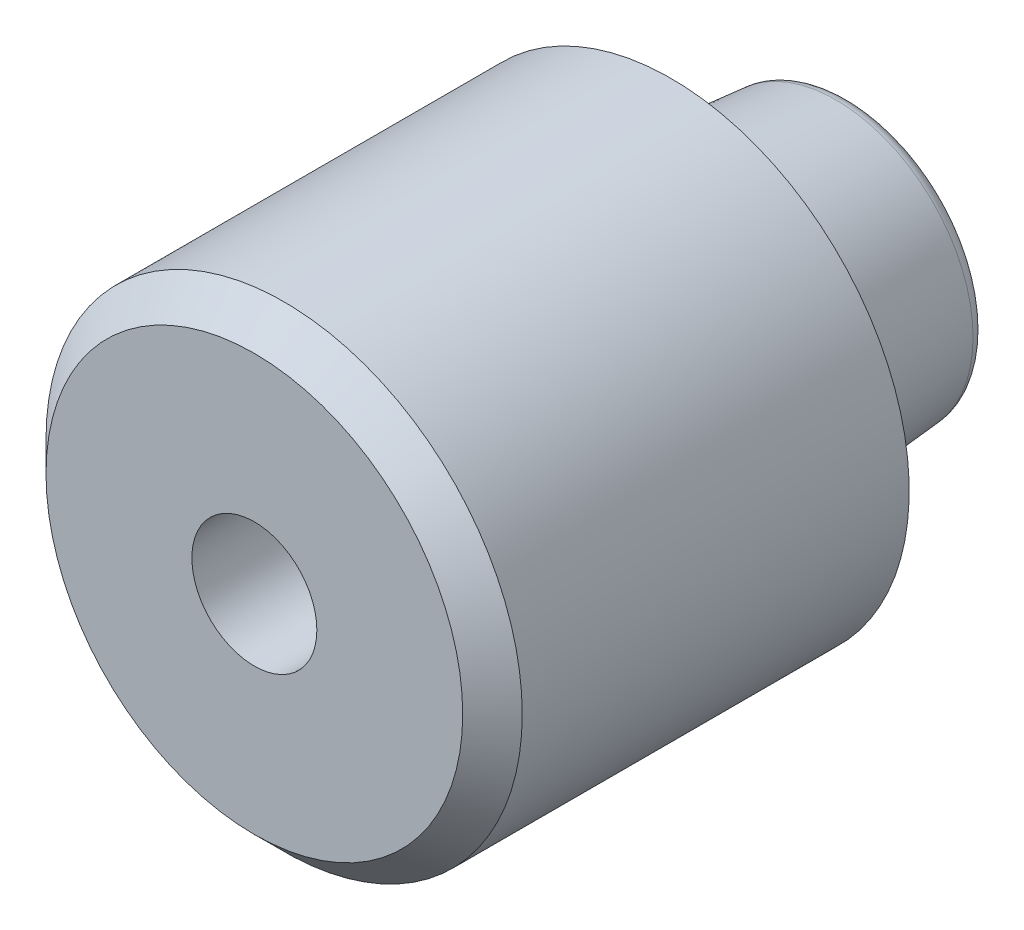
ISO-10303-21;
HEADER;
FILE_DESCRIPTION(('STEP AP214'),'2;1');
FILE_NAME('part.step','',(''),(''),'','','');
FILE_SCHEMA(('AUTOMOTIVE_DESIGN { 1 0 10303 214 1 1 1 1 }'));
ENDSEC;
DATA;
#1=APPLICATION_CONTEXT('core data for automotive mechanical design processes');
#2=APPLICATION_PROTOCOL_DEFINITION('international standard','automotive_design',2000,#1);
#3=PRODUCT_CONTEXT('',#1,'mechanical');
#4=PRODUCT('Part','Part','',(#3));
#5=PRODUCT_RELATED_PRODUCT_CATEGORY('part','',(#4));
#6=PRODUCT_DEFINITION_FORMATION('','',#4);
#7=PRODUCT_DEFINITION_CONTEXT('part definition',#1,'design');
#8=PRODUCT_DEFINITION('design','',#6,#7);
#9=PRODUCT_DEFINITION_SHAPE('','',#8);
#10=(LENGTH_UNIT() NAMED_UNIT(*) SI_UNIT(.MILLI.,.METRE.));
#11=(NAMED_UNIT(*) PLANE_ANGLE_UNIT() SI_UNIT($,.RADIAN.));
#12=(NAMED_UNIT(*) SI_UNIT($,.STERADIAN.) SOLID_ANGLE_UNIT());
#13=UNCERTAINTY_MEASURE_WITH_UNIT(LENGTH_MEASURE(1.E-05),#10,'distance_accuracy_value','');
#14=(GEOMETRIC_REPRESENTATION_CONTEXT(3) GLOBAL_UNCERTAINTY_ASSIGNED_CONTEXT((#13)) GLOBAL_UNIT_ASSIGNED_CONTEXT((#10,
#11,#12)) REPRESENTATION_CONTEXT('',''));
#15=CARTESIAN_POINT('',(0.,0.,0.));
#16=DIRECTION('',(0.,0.,1.));
#17=DIRECTION('',(1.,0.,0.));
#18=AXIS2_PLACEMENT_3D('',#15,#16,#17);
#19=CARTESIAN_POINT('',(0.,0.,10.6862915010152));
#20=DIRECTION('',(0.,0.,-1.));
#21=DIRECTION('',(1.,0.,0.));
#22=AXIS2_PLACEMENT_3D('',#19,#20,#21);
#23=CONICAL_SURFACE('',#22,11.3137084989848,0.785398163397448);
#24=CARTESIAN_POINT('',(1.04744440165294E-13,0.,15.));
#25=DIRECTION('',(0.,0.,-1.));
#26=DIRECTION('',(-1.,0.,0.));
#27=AXIS2_PLACEMENT_3D('',#24,#25,#26);
#28=CIRCLE('',#27,7.);
#29=CARTESIAN_POINT('',(-6.9999999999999,0.,15.));
#30=VERTEX_POINT('',#29);
#31=CARTESIAN_POINT('',(7.00000000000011,0.,15.));
#32=VERTEX_POINT('',#31);
#33=EDGE_CURVE('E59',#30,#32,#28,.T.);
#34=ORIENTED_EDGE('',*,*,#33,.T.);
#35=CARTESIAN_POINT('',(7.00000107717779,0.,14.9999989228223));
#36=CARTESIAN_POINT('',(7.99999833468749,0.,14.0000016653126));
#37=B_SPLINE_CURVE_WITH_KNOTS('',1,(#35,#36),.UNSPECIFIED.,.F.,.F.,(2,2),(0.618718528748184,
0.707106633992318),.UNSPECIFIED.);
#38=CARTESIAN_POINT('',(8.0000000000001,0.,14.));
#39=VERTEX_POINT('',#38);
#40=EDGE_CURVE('E46',#32,#39,#37,.T.);
#41=ORIENTED_EDGE('',*,*,#40,.T.);
#42=CARTESIAN_POINT('',(0.,0.,14.));
#43=DIRECTION('',(0.,0.,1.));
#44=DIRECTION('',(-1.,0.,0.));
#45=AXIS2_PLACEMENT_3D('',#42,#43,#44);
#46=CIRCLE('',#45,8.);
#47=CARTESIAN_POINT('',(-7.9999999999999,0.,14.));
#48=VERTEX_POINT('',#47);
#49=EDGE_CURVE('E97',#39,#48,#46,.T.);
#50=ORIENTED_EDGE('',*,*,#49,.T.);
#51=CARTESIAN_POINT('',(0.,0.,14.));
#52=DIRECTION('',(0.,0.,1.));
#53=DIRECTION('',(-1.,0.,0.));
#54=AXIS2_PLACEMENT_3D('',#51,#52,#53);
#55=CIRCLE('',#54,8.);
#56=EDGE_CURVE('E11',#48,#39,#55,.T.);
#57=ORIENTED_EDGE('',*,*,#56,.T.);
#58=ORIENTED_EDGE('',*,*,#40,.F.);
#59=CARTESIAN_POINT('',(1.04744440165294E-13,0.,15.));
#60=DIRECTION('',(0.,0.,-1.));
#61=DIRECTION('',(-1.,0.,0.));
#62=AXIS2_PLACEMENT_3D('',#59,#60,#61);
#63=CIRCLE('',#62,7.);
#64=EDGE_CURVE('E94',#32,#30,#63,.T.);
#65=ORIENTED_EDGE('',*,*,#64,.T.);
#66=EDGE_LOOP('',(#34,#41,#50,#57,#58,#65));
#67=FACE_BOUND('',#66,.T.);
#68=ADVANCED_FACE('F38',(#67),#23,.T.);
#69=CARTESIAN_POINT('',(0.,0.,8.));
#70=DIRECTION('',(0.,0.,-1.));
#71=DIRECTION('',(-1.,0.,0.));
#72=AXIS2_PLACEMENT_3D('',#69,#70,#71);
#73=CYLINDRICAL_SURFACE('',#72,8.);
#74=ORIENTED_EDGE('',*,*,#49,.F.);
#75=ORIENTED_EDGE('',*,*,#56,.F.);
#76=CARTESIAN_POINT('',(-7.9999999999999,0.,13.9999990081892));
#77=CARTESIAN_POINT('',(-8.,0.,0.999998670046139));
#78=B_SPLINE_CURVE_WITH_KNOTS('',1,(#76,#77),.UNSPECIFIED.,.F.,.F.,(2,2),(0.0833333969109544,
0.916666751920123),.UNSPECIFIED.);
#79=CARTESIAN_POINT('',(-8.,0.,1.00000000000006));
#80=VERTEX_POINT('',#79);
#81=EDGE_CURVE('E132',#48,#80,#78,.T.);
#82=ORIENTED_EDGE('',*,*,#81,.T.);
#83=CARTESIAN_POINT('',(0.,0.,1.));
#84=DIRECTION('',(0.,0.,-1.));
#85=DIRECTION('',(-1.,0.,0.));
#86=AXIS2_PLACEMENT_3D('',#83,#84,#85);
#87=CIRCLE('',#86,8.);
#88=EDGE_CURVE('E137',#80,#80,#87,.T.);
#89=ORIENTED_EDGE('',*,*,#88,.F.);
#90=ORIENTED_EDGE('',*,*,#81,.F.);
#91=EDGE_LOOP('',(#74,#75,#82,#89,#90));
#92=FACE_BOUND('',#91,.T.);
#93=ADVANCED_FACE('F182',(#92),#73,.T.);
#94=CARTESIAN_POINT('',(-9.0999999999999,-14.5492267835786,15.));
#95=DIRECTION('',(0.,0.,1.));
#96=DIRECTION('',(1.,0.,0.));
#97=AXIS2_PLACEMENT_3D('',#94,#95,#96);
#98=PLANE('',#97);
#99=CARTESIAN_POINT('',(0.,0.,14.9999999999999));
#100=DIRECTION('',(0.,0.,1.));
#101=DIRECTION('',(1.,0.,0.));
#102=AXIS2_PLACEMENT_3D('',#99,#100,#101);
#103=CIRCLE('',#102,2.09999999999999);
#104=CARTESIAN_POINT('',(2.09999999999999,0.,14.9999999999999));
#105=VERTEX_POINT('',#104);
#106=EDGE_CURVE('E95',#105,#105,#103,.T.);
#107=ORIENTED_EDGE('',*,*,#106,.F.);
#108=EDGE_LOOP('',(#107));
#109=FACE_BOUND('',#108,.T.);
#110=ORIENTED_EDGE('',*,*,#64,.F.);
#111=ORIENTED_EDGE('',*,*,#33,.F.);
#112=EDGE_LOOP('',(#110,#111));
#113=FACE_BOUND('',#112,.T.);
#114=ADVANCED_FACE('F185',(#109,#113),#98,.T.);
#115=CARTESIAN_POINT('',(0.,0.,-4.5));
#116=DIRECTION('',(0.,0.,-1.));
#117=DIRECTION('',(-1.,0.,0.));
#118=AXIS2_PLACEMENT_3D('',#115,#116,#117);
#119=TOROIDAL_SURFACE('',#118,4.10439109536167,0.5);
#120=CARTESIAN_POINT('',(0.,0.,-4.54357787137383));
#121=DIRECTION('',(0.,0.,-1.));
#122=DIRECTION('',(-1.,0.,0.));
#123=AXIS2_PLACEMENT_3D('',#120,#121,#122);
#124=CIRCLE('',#123,4.60248844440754);
#125=CARTESIAN_POINT('',(-4.60248844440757,0.,-4.5435778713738));
#126=VERTEX_POINT('',#125);
#127=EDGE_CURVE('E138',#126,#126,#124,.T.);
#128=ORIENTED_EDGE('',*,*,#127,.T.);
#129=CARTESIAN_POINT('',(-4.60248844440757,0.,-4.5435778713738));
#130=CARTESIAN_POINT('',(-4.56255668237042,0.,-4.99999999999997));
#131=CARTESIAN_POINT('',(-4.1043910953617,0.,-5.));
#132=(BOUNDED_CURVE() B_SPLINE_CURVE(2,(#129,#130,#131),.UNSPECIFIED.,.F.,
.F.) B_SPLINE_CURVE_WITH_KNOTS((3,3),(0.,0.5),
.UNSPECIFIED.) CURVE() GEOMETRIC_REPRESENTATION_ITEM() RATIONAL_B_SPLINE_CURVE((1.,
0.737277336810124,1.)) REPRESENTATION_ITEM(''));
#133=CARTESIAN_POINT('',(-4.1043910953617,0.,-5.));
#134=VERTEX_POINT('',#133);
#135=EDGE_CURVE('E121',#126,#134,#132,.T.);
#136=ORIENTED_EDGE('',*,*,#135,.T.);
#137=CARTESIAN_POINT('',(0.,0.,-5.));
#138=DIRECTION('',(0.,0.,1.));
#139=DIRECTION('',(-1.,0.,0.));
#140=AXIS2_PLACEMENT_3D('',#137,#138,#139);
#141=CIRCLE('',#140,4.10439109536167);
#142=EDGE_CURVE('E127',#134,#134,#141,.T.);
#143=ORIENTED_EDGE('',*,*,#142,.T.);
#144=ORIENTED_EDGE('',*,*,#135,.F.);
#145=EDGE_LOOP('',(#128,#136,#143,#144));
#146=FACE_BOUND('',#145,.T.);
#147=ADVANCED_FACE('F187',(#146),#119,.T.);
#148=CARTESIAN_POINT('',(0.,0.,0.));
#149=DIRECTION('',(0.,0.,1.));
#150=DIRECTION('',(-1.,0.,0.));
#151=AXIS2_PLACEMENT_3D('',#148,#149,#150);
#152=CONICAL_SURFACE('',#151,5.,0.0872664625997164);
#153=ORIENTED_EDGE('',*,*,#127,.F.);
#154=CARTESIAN_POINT('',(-4.60248844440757,0.,-4.5435778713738));
#155=CARTESIAN_POINT('',(-5.,0.,0.));
#156=B_SPLINE_CURVE_WITH_KNOTS('',1,(#154,#155),.UNSPECIFIED.,.F.,.F.,(2,2),(0.,1.),.UNSPECIFIED.);
#157=CARTESIAN_POINT('',(-5.,0.,0.));
#158=VERTEX_POINT('',#157);
#159=EDGE_CURVE('E110',#126,#158,#156,.T.);
#160=ORIENTED_EDGE('',*,*,#159,.T.);
#161=CARTESIAN_POINT('',(0.,0.,0.));
#162=DIRECTION('',(0.,0.,-1.));
#163=DIRECTION('',(-1.,0.,0.));
#164=AXIS2_PLACEMENT_3D('',#161,#162,#163);
#165=CIRCLE('',#164,5.);
#166=EDGE_CURVE('E116',#158,#158,#165,.T.);
#167=ORIENTED_EDGE('',*,*,#166,.T.);
#168=ORIENTED_EDGE('',*,*,#159,.F.);
#169=EDGE_LOOP('',(#153,#160,#167,#168));
#170=FACE_BOUND('',#169,.T.);
#171=ADVANCED_FACE('F194',(#170),#152,.T.);
#172=CARTESIAN_POINT('',(9.4400995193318,-8.53081669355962,-5.00000000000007));
#173=DIRECTION('',(0.,0.,-1.));
#174=DIRECTION('',(-1.,0.,0.));
#175=AXIS2_PLACEMENT_3D('',#172,#173,#174);
#176=PLANE('',#175);
#177=ORIENTED_EDGE('',*,*,#142,.F.);
#178=EDGE_LOOP('',(#177));
#179=FACE_BOUND('',#178,.T.);
#180=ADVANCED_FACE('F222',(#179),#176,.T.);
#181=CARTESIAN_POINT('',(0.,0.,0.5));
#182=DIRECTION('',(0.,0.,-1.));
#183=DIRECTION('',(-1.,0.,0.));
#184=AXIS2_PLACEMENT_3D('',#181,#182,#183);
#185=CYLINDRICAL_SURFACE('',#184,5.);
#186=CARTESIAN_POINT('',(0.,0.,1.));
#187=DIRECTION('',(0.,0.,1.));
#188=DIRECTION('',(-1.,0.,0.));
#189=AXIS2_PLACEMENT_3D('',#186,#187,#188);
#190=CIRCLE('',#189,5.);
#191=CARTESIAN_POINT('',(-5.,0.,1.00000000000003));
#192=VERTEX_POINT('',#191);
#193=EDGE_CURVE('E105',#192,#192,#190,.T.);
#194=ORIENTED_EDGE('',*,*,#193,.F.);
#195=CARTESIAN_POINT('',(-5.,0.,1.00000305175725));
#196=CARTESIAN_POINT('',(-5.,0.,5.31746910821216E-07));
#197=B_SPLINE_CURVE_WITH_KNOTS('',1,(#195,#196),.UNSPECIFIED.,.F.,.F.,(2,2),(0.0833307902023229,
0.91666622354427),.UNSPECIFIED.);
#198=EDGE_CURVE('E102',#192,#158,#197,.T.);
#199=ORIENTED_EDGE('',*,*,#198,.T.);
#200=ORIENTED_EDGE('',*,*,#166,.F.);
#201=ORIENTED_EDGE('',*,*,#198,.F.);
#202=EDGE_LOOP('',(#194,#199,#200,#201));
#203=FACE_BOUND('',#202,.T.);
#204=ADVANCED_FACE('F231',(#203),#185,.T.);
#205=CARTESIAN_POINT('',(18.4,-16.6276877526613,0.999999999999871));
#206=DIRECTION('',(0.,0.,-1.));
#207=DIRECTION('',(-1.,0.,0.));
#208=AXIS2_PLACEMENT_3D('',#205,#206,#207);
#209=PLANE('',#208);
#210=ORIENTED_EDGE('',*,*,#88,.T.);
#211=EDGE_LOOP('',(#210));
#212=FACE_BOUND('',#211,.T.);
#213=ORIENTED_EDGE('',*,*,#193,.T.);
#214=EDGE_LOOP('',(#213));
#215=FACE_BOUND('',#214,.T.);
#216=ADVANCED_FACE('F88',(#212,#215),#209,.T.);
#217=CARTESIAN_POINT('',(0.,0.,2.99999999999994));
#218=DIRECTION('',(0.,0.,1.));
#219=DIRECTION('',(1.,0.,0.));
#220=AXIS2_PLACEMENT_3D('',#217,#218,#219);
#221=CONICAL_SURFACE('',#220,2.1,1.02974425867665);
#222=CARTESIAN_POINT('',(0.,0.,1.73819270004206));
#223=VERTEX_POINT('',#222);
#224=VERTEX_LOOP('',#223);
#225=FACE_BOUND('',#224,.T.);
#226=CARTESIAN_POINT('',(0.,0.,2.99999999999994));
#227=DIRECTION('',(0.,0.,1.));
#228=DIRECTION('',(1.,0.,0.));
#229=AXIS2_PLACEMENT_3D('',#226,#227,#228);
#230=CIRCLE('',#229,2.1);
#231=CARTESIAN_POINT('',(2.1,0.,2.99999999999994));
#232=VERTEX_POINT('',#231);
#233=EDGE_CURVE('E92',#232,#232,#230,.T.);
#234=ORIENTED_EDGE('',*,*,#233,.T.);
#235=EDGE_LOOP('',(#234));
#236=FACE_BOUND('',#235,.T.);
#237=ADVANCED_FACE('F84',(#225,#236),#221,.F.);
#238=CARTESIAN_POINT('',(0.,0.,14.9999999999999));
#239=DIRECTION('',(0.,0.,1.));
#240=DIRECTION('',(1.,0.,0.));
#241=AXIS2_PLACEMENT_3D('',#238,#239,#240);
#242=CYLINDRICAL_SURFACE('',#241,2.09999999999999);
#243=ORIENTED_EDGE('',*,*,#233,.F.);
#244=EDGE_LOOP('',(#243));
#245=FACE_BOUND('',#244,.T.);
#246=ORIENTED_EDGE('',*,*,#106,.T.);
#247=EDGE_LOOP('',(#246));
#248=FACE_BOUND('',#247,.T.);
#249=ADVANCED_FACE('F87',(#245,#248),#242,.F.);
#250=CLOSED_SHELL('',(#68,#93,#114,#147,#171,#180,#204,#216,#237,#249));
#251=MANIFOLD_SOLID_BREP('B2',#250);
#252=ADVANCED_BREP_SHAPE_REPRESENTATION('',(#18,#251),#14);
#253=SHAPE_DEFINITION_REPRESENTATION(#9,#252);
ENDSEC;
END-ISO-10303-21;
